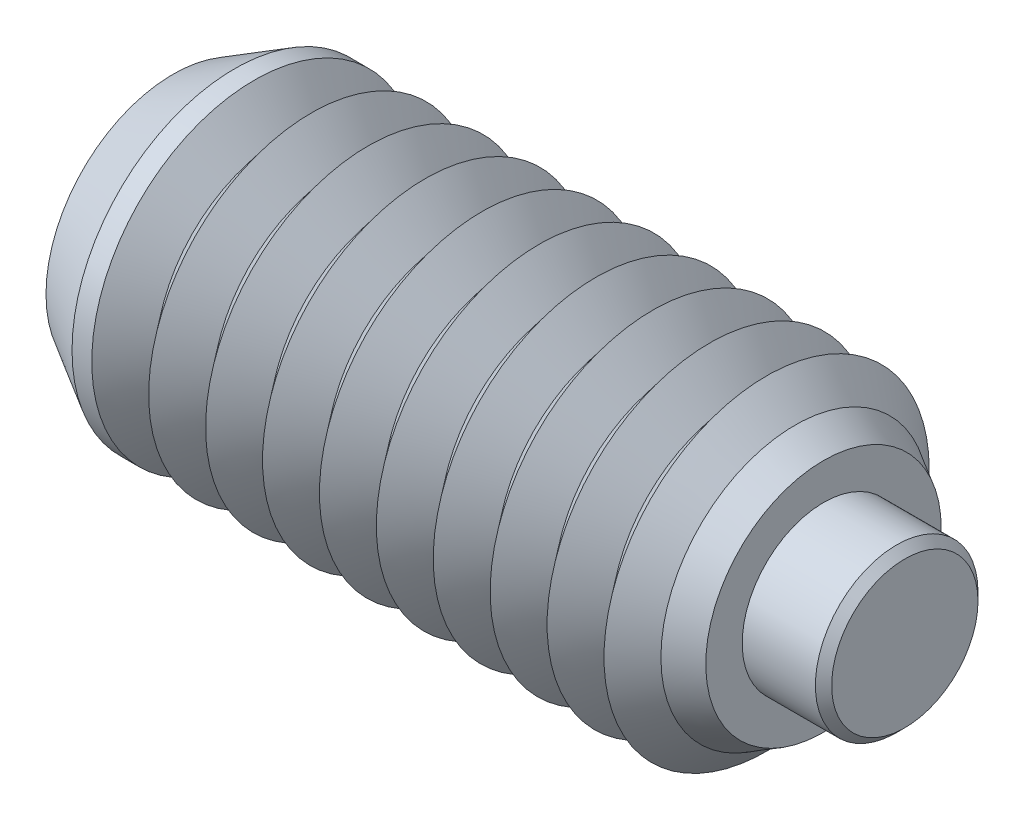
ISO-10303-21;
HEADER;
FILE_DESCRIPTION(('STEP AP214'),'2;1');
FILE_NAME('part.step','',(''),(''),'','','');
FILE_SCHEMA(('AUTOMOTIVE_DESIGN { 1 0 10303 214 1 1 1 1 }'));
ENDSEC;
DATA;
#1=APPLICATION_CONTEXT('core data for automotive mechanical design processes');
#2=APPLICATION_PROTOCOL_DEFINITION('international standard','automotive_design',2000,#1);
#3=PRODUCT_CONTEXT('',#1,'mechanical');
#4=PRODUCT('Part','Part','',(#3));
#5=PRODUCT_RELATED_PRODUCT_CATEGORY('part','',(#4));
#6=PRODUCT_DEFINITION_FORMATION('','',#4);
#7=PRODUCT_DEFINITION_CONTEXT('part definition',#1,'design');
#8=PRODUCT_DEFINITION('design','',#6,#7);
#9=PRODUCT_DEFINITION_SHAPE('','',#8);
#10=(LENGTH_UNIT() NAMED_UNIT(*) SI_UNIT(.MILLI.,.METRE.));
#11=(NAMED_UNIT(*) PLANE_ANGLE_UNIT() SI_UNIT($,.RADIAN.));
#12=(NAMED_UNIT(*) SI_UNIT($,.STERADIAN.) SOLID_ANGLE_UNIT());
#13=UNCERTAINTY_MEASURE_WITH_UNIT(LENGTH_MEASURE(1.E-05),#10,'distance_accuracy_value','');
#14=(GEOMETRIC_REPRESENTATION_CONTEXT(3) GLOBAL_UNCERTAINTY_ASSIGNED_CONTEXT((#13)) GLOBAL_UNIT_ASSIGNED_CONTEXT((#10,
#11,#12)) REPRESENTATION_CONTEXT('',''));
#15=CARTESIAN_POINT('',(0.,0.,0.));
#16=DIRECTION('',(0.,0.,1.));
#17=DIRECTION('',(1.,0.,0.));
#18=AXIS2_PLACEMENT_3D('',#15,#16,#17);
#19=CARTESIAN_POINT('',(1.35,0.,0.));
#20=DIRECTION('',(-1.,0.,0.));
#21=DIRECTION('',(0.,0.,1.));
#22=AXIS2_PLACEMENT_3D('',#19,#20,#21);
#23=CYLINDRICAL_SURFACE('',#22,1.);
#24=CARTESIAN_POINT('',(1.25,0.,0.));
#25=DIRECTION('',(1.,0.,0.));
#26=DIRECTION('',(0.,0.,-1.));
#27=AXIS2_PLACEMENT_3D('',#24,#25,#26);
#28=CIRCLE('',#27,1.);
#29=CARTESIAN_POINT('',(1.25,0.,-1.));
#30=VERTEX_POINT('',#29);
#31=EDGE_CURVE('P0_E10',#30,#30,#28,.F.);
#32=ORIENTED_EDGE('',*,*,#31,.T.);
#33=EDGE_LOOP('',(#32));
#34=FACE_BOUND('',#33,.T.);
#35=CARTESIAN_POINT('',(-0.65,0.,0.));
#36=DIRECTION('',(1.,0.,0.));
#37=DIRECTION('',(0.,0.,-1.));
#38=AXIS2_PLACEMENT_3D('',#35,#36,#37);
#39=CIRCLE('',#38,1.);
#40=CARTESIAN_POINT('',(-0.65,0.,-1.));
#41=VERTEX_POINT('',#40);
#42=EDGE_CURVE('P0_E25',#41,#41,#39,.T.);
#43=ORIENTED_EDGE('',*,*,#42,.T.);
#44=EDGE_LOOP('',(#43));
#45=FACE_BOUND('',#44,.T.);
#46=ADVANCED_FACE('P0_F14',(#34,#45),#23,.T.);
#47=CARTESIAN_POINT('',(1.35,0.,0.));
#48=DIRECTION('',(1.,0.,0.));
#49=DIRECTION('',(0.,0.,-1.));
#50=AXIS2_PLACEMENT_3D('',#47,#48,#49);
#51=PLANE('',#50);
#52=CARTESIAN_POINT('',(1.35,0.,0.));
#53=DIRECTION('',(1.,0.,0.));
#54=DIRECTION('',(0.,0.,-1.));
#55=AXIS2_PLACEMENT_3D('',#52,#53,#54);
#56=CIRCLE('',#55,0.899999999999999);
#57=CARTESIAN_POINT('',(1.35,0.,-0.899999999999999));
#58=VERTEX_POINT('',#57);
#59=EDGE_CURVE('P0_E21',#58,#58,#56,.T.);
#60=ORIENTED_EDGE('',*,*,#59,.T.);
#61=EDGE_LOOP('',(#60));
#62=FACE_BOUND('',#61,.T.);
#63=ADVANCED_FACE('P0_F35',(#62),#51,.T.);
#64=CARTESIAN_POINT('',(-0.65,0.,0.));
#65=DIRECTION('',(1.,0.,0.));
#66=DIRECTION('',(0.,0.,-1.));
#67=AXIS2_PLACEMENT_3D('',#64,#65,#66);
#68=PLANE('',#67);
#69=ORIENTED_EDGE('',*,*,#42,.F.);
#70=EDGE_LOOP('',(#69));
#71=FACE_BOUND('',#70,.T.);
#72=ADVANCED_FACE('P0_F33',(#71),#68,.F.);
#73=CARTESIAN_POINT('',(1.35,0.,0.));
#74=DIRECTION('',(-1.,0.,0.));
#75=DIRECTION('',(0.,0.,1.));
#76=AXIS2_PLACEMENT_3D('',#73,#74,#75);
#77=CONICAL_SURFACE('',#76,0.899999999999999,0.785398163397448);
#78=ORIENTED_EDGE('',*,*,#31,.F.);
#79=EDGE_LOOP('',(#78));
#80=FACE_BOUND('',#79,.T.);
#81=ORIENTED_EDGE('',*,*,#59,.F.);
#82=EDGE_LOOP('',(#81));
#83=FACE_BOUND('',#82,.T.);
#84=ADVANCED_FACE('P0_F16',(#80,#83),#77,.T.);
#85=CLOSED_SHELL('',(#46,#63,#72,#84));
#86=MANIFOLD_SOLID_BREP('P0_B1',#85);
#87=CARTESIAN_POINT('',(-7.65,0.,0.));
#88=DIRECTION('',(1.,0.,0.));
#89=DIRECTION('',(0.,0.,-1.));
#90=AXIS2_PLACEMENT_3D('',#87,#88,#89);
#91=CYLINDRICAL_SURFACE('',#90,2.);
#92=CARTESIAN_POINT('',(-6.65,0.,0.));
#93=DIRECTION('',(1.,0.,0.));
#94=DIRECTION('',(0.,0.,-1.));
#95=AXIS2_PLACEMENT_3D('',#92,#93,#94);
#96=CIRCLE('',#95,2.);
#97=CARTESIAN_POINT('',(-6.65,0.,-2.));
#98=VERTEX_POINT('',#97);
#99=EDGE_CURVE('P1_E226',#98,#98,#96,.T.);
#100=ORIENTED_EDGE('',*,*,#99,.F.);
#101=EDGE_LOOP('',(#100));
#102=FACE_BOUND('',#101,.T.);
#103=CARTESIAN_POINT('',(-6.89283423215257,0.,0.));
#104=DIRECTION('',(1.,0.,0.));
#105=DIRECTION('',(0.,0.,-1.));
#106=AXIS2_PLACEMENT_3D('',#103,#104,#105);
#107=CIRCLE('',#106,2.);
#108=CARTESIAN_POINT('',(-6.89283423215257,0.,-2.));
#109=VERTEX_POINT('',#108);
#110=EDGE_CURVE('P1_E229',#109,#109,#107,.T.);
#111=ORIENTED_EDGE('',*,*,#110,.T.);
#112=EDGE_LOOP('',(#111));
#113=FACE_BOUND('',#112,.T.);
#114=ADVANCED_FACE('P1_F15',(#102,#113),#91,.T.);
#115=CARTESIAN_POINT('',(-0.700000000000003,0.,0.));
#116=DIRECTION('',(1.,0.,0.));
#117=DIRECTION('',(0.,0.,-1.));
#118=AXIS2_PLACEMENT_3D('',#115,#116,#117);
#119=CONICAL_SURFACE('',#118,1.56285014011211,0.895664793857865);
#120=CARTESIAN_POINT('',(-0.350000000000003,0.,0.));
#121=DIRECTION('',(1.,0.,0.));
#122=DIRECTION('',(0.,0.,-1.));
#123=AXIS2_PLACEMENT_3D('',#120,#121,#122);
#124=CIRCLE('',#123,2.);
#125=CARTESIAN_POINT('',(-0.350000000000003,0.,-2.));
#126=VERTEX_POINT('',#125);
#127=EDGE_CURVE('P1_E284',#126,#126,#124,.T.);
#128=ORIENTED_EDGE('',*,*,#127,.F.);
#129=EDGE_LOOP('',(#128));
#130=FACE_BOUND('',#129,.T.);
#131=CARTESIAN_POINT('',(-0.700000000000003,0.,0.));
#132=DIRECTION('',(1.,0.,0.));
#133=DIRECTION('',(0.,0.,-1.));
#134=AXIS2_PLACEMENT_3D('',#131,#132,#133);
#135=CIRCLE('',#134,1.56285014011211);
#136=CARTESIAN_POINT('',(-0.700000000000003,0.,-1.56285014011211));
#137=VERTEX_POINT('',#136);
#138=EDGE_CURVE('P1_E289',#137,#137,#135,.T.);
#139=ORIENTED_EDGE('',*,*,#138,.T.);
#140=EDGE_LOOP('',(#139));
#141=FACE_BOUND('',#140,.T.);
#142=ADVANCED_FACE('P1_F214',(#130,#141),#119,.T.);
#143=CARTESIAN_POINT('',(-1.05,0.,0.));
#144=DIRECTION('',(-1.,0.,0.));
#145=DIRECTION('',(0.,0.,1.));
#146=AXIS2_PLACEMENT_3D('',#143,#144,#145);
#147=CONICAL_SURFACE('',#146,2.,0.895664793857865);
#148=ORIENTED_EDGE('',*,*,#138,.F.);
#149=EDGE_LOOP('',(#148));
#150=FACE_BOUND('',#149,.T.);
#151=CARTESIAN_POINT('',(-1.05,0.,0.));
#152=DIRECTION('',(1.,0.,0.));
#153=DIRECTION('',(0.,0.,-1.));
#154=AXIS2_PLACEMENT_3D('',#151,#152,#153);
#155=CIRCLE('',#154,2.);
#156=CARTESIAN_POINT('',(-1.05,0.,-2.));
#157=VERTEX_POINT('',#156);
#158=EDGE_CURVE('P1_E292',#157,#157,#155,.T.);
#159=ORIENTED_EDGE('',*,*,#158,.T.);
#160=EDGE_LOOP('',(#159));
#161=FACE_BOUND('',#160,.T.);
#162=ADVANCED_FACE('P1_F220',(#150,#161),#147,.T.);
#163=CARTESIAN_POINT('',(-0.65,0.,0.));
#164=DIRECTION('',(1.,0.,0.));
#165=DIRECTION('',(0.,1.,0.));
#166=AXIS2_PLACEMENT_3D('',#163,#164,#165);
#167=PLANE('',#166);
#168=CARTESIAN_POINT('',(-0.65,0.,0.));
#169=DIRECTION('',(1.,0.,0.));
#170=DIRECTION('',(0.,1.,0.));
#171=AXIS2_PLACEMENT_3D('',#168,#169,#170);
#172=CIRCLE('',#171,1.);
#173=CARTESIAN_POINT('',(-0.65,1.,0.));
#174=VERTEX_POINT('',#173);
#175=EDGE_CURVE('P1_E279',#174,#174,#172,.T.);
#176=ORIENTED_EDGE('',*,*,#175,.T.);
#177=EDGE_LOOP('',(#176));
#178=FACE_BOUND('',#177,.T.);
#179=ADVANCED_FACE('P1_F409',(#178),#167,.T.);
#180=CARTESIAN_POINT('',(-0.65,0.,0.));
#181=DIRECTION('',(1.,0.,0.));
#182=DIRECTION('',(0.,1.,0.));
#183=AXIS2_PLACEMENT_3D('',#180,#181,#182);
#184=CYLINDRICAL_SURFACE('',#183,1.);
#185=ORIENTED_EDGE('',*,*,#175,.F.);
#186=EDGE_LOOP('',(#185));
#187=FACE_BOUND('',#186,.T.);
#188=CARTESIAN_POINT('',(0.35,0.,0.));
#189=DIRECTION('',(1.,0.,0.));
#190=DIRECTION('',(0.,1.,0.));
#191=AXIS2_PLACEMENT_3D('',#188,#189,#190);
#192=CIRCLE('',#191,1.);
#193=CARTESIAN_POINT('',(0.35,1.,0.));
#194=VERTEX_POINT('',#193);
#195=EDGE_CURVE('P1_E281',#194,#194,#192,.T.);
#196=ORIENTED_EDGE('',*,*,#195,.T.);
#197=EDGE_LOOP('',(#196));
#198=FACE_BOUND('',#197,.T.);
#199=ADVANCED_FACE('P1_F210',(#187,#198),#184,.F.);
#200=CARTESIAN_POINT('',(0.35,1.44792740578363,0.));
#201=DIRECTION('',(1.,0.,0.));
#202=DIRECTION('',(0.,1.,0.));
#203=AXIS2_PLACEMENT_3D('',#200,#201,#202);
#204=PLANE('',#203);
#205=ORIENTED_EDGE('',*,*,#195,.F.);
#206=EDGE_LOOP('',(#205));
#207=FACE_BOUND('',#206,.T.);
#208=CARTESIAN_POINT('',(0.35,0.,0.));
#209=DIRECTION('',(1.,0.,0.));
#210=DIRECTION('',(0.,1.,0.));
#211=AXIS2_PLACEMENT_3D('',#208,#209,#210);
#212=CIRCLE('',#211,1.44792740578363);
#213=CARTESIAN_POINT('',(0.35,1.44792740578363,0.));
#214=VERTEX_POINT('',#213);
#215=EDGE_CURVE('P1_E121',#214,#214,#212,.T.);
#216=ORIENTED_EDGE('',*,*,#215,.T.);
#217=EDGE_LOOP('',(#216));
#218=FACE_BOUND('',#217,.T.);
#219=ADVANCED_FACE('P1_F206',(#207,#218),#204,.T.);
#220=CARTESIAN_POINT('',(0.35,0.,0.));
#221=DIRECTION('',(-1.,0.,0.));
#222=DIRECTION('',(0.,-1.,0.));
#223=AXIS2_PLACEMENT_3D('',#220,#221,#222);
#224=CONICAL_SURFACE('',#223,1.44792740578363,0.523598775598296);
#225=CARTESIAN_POINT('',(0.,0.,0.));
#226=DIRECTION('',(1.,0.,0.));
#227=DIRECTION('',(0.,0.,-1.));
#228=AXIS2_PLACEMENT_3D('',#225,#226,#227);
#229=CIRCLE('',#228,1.65);
#230=CARTESIAN_POINT('',(0.,0.,-1.65));
#231=VERTEX_POINT('',#230);
#232=EDGE_CURVE('P1_E236',#231,#231,#229,.T.);
#233=ORIENTED_EDGE('',*,*,#232,.T.);
#234=EDGE_LOOP('',(#233));
#235=FACE_BOUND('',#234,.T.);
#236=ORIENTED_EDGE('',*,*,#215,.F.);
#237=EDGE_LOOP('',(#236));
#238=FACE_BOUND('',#237,.T.);
#239=ADVANCED_FACE('P1_F203',(#235,#238),#224,.T.);
#240=CARTESIAN_POINT('',(0.,0.,0.));
#241=DIRECTION('',(-1.,0.,0.));
#242=DIRECTION('',(0.,0.,1.));
#243=AXIS2_PLACEMENT_3D('',#240,#241,#242);
#244=CONICAL_SURFACE('',#243,1.65,0.785398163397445);
#245=ORIENTED_EDGE('',*,*,#127,.T.);
#246=EDGE_LOOP('',(#245));
#247=FACE_BOUND('',#246,.T.);
#248=ORIENTED_EDGE('',*,*,#232,.F.);
#249=EDGE_LOOP('',(#248));
#250=FACE_BOUND('',#249,.T.);
#251=ADVANCED_FACE('P1_F17',(#247,#250),#244,.T.);
#252=CARTESIAN_POINT('',(-1.4,0.,0.));
#253=DIRECTION('',(1.,0.,0.));
#254=DIRECTION('',(0.,0.,-1.));
#255=AXIS2_PLACEMENT_3D('',#252,#253,#254);
#256=CONICAL_SURFACE('',#255,1.56285014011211,0.895664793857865);
#257=ORIENTED_EDGE('',*,*,#158,.F.);
#258=EDGE_LOOP('',(#257));
#259=FACE_BOUND('',#258,.T.);
#260=CARTESIAN_POINT('',(-1.4,0.,0.));
#261=DIRECTION('',(1.,0.,0.));
#262=DIRECTION('',(0.,0.,-1.));
#263=AXIS2_PLACEMENT_3D('',#260,#261,#262);
#264=CIRCLE('',#263,1.56285014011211);
#265=CARTESIAN_POINT('',(-1.4,0.,-1.56285014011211));
#266=VERTEX_POINT('',#265);
#267=EDGE_CURVE('P1_E295',#266,#266,#264,.T.);
#268=ORIENTED_EDGE('',*,*,#267,.T.);
#269=EDGE_LOOP('',(#268));
#270=FACE_BOUND('',#269,.T.);
#271=ADVANCED_FACE('P1_F403',(#259,#270),#256,.T.);
#272=CARTESIAN_POINT('',(-1.75,0.,0.));
#273=DIRECTION('',(-1.,0.,0.));
#274=DIRECTION('',(0.,0.,1.));
#275=AXIS2_PLACEMENT_3D('',#272,#273,#274);
#276=CONICAL_SURFACE('',#275,2.,0.895664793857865);
#277=ORIENTED_EDGE('',*,*,#267,.F.);
#278=EDGE_LOOP('',(#277));
#279=FACE_BOUND('',#278,.T.);
#280=CARTESIAN_POINT('',(-1.75,0.,0.));
#281=DIRECTION('',(1.,0.,0.));
#282=DIRECTION('',(0.,0.,-1.));
#283=AXIS2_PLACEMENT_3D('',#280,#281,#282);
#284=CIRCLE('',#283,2.);
#285=CARTESIAN_POINT('',(-1.75,0.,-2.));
#286=VERTEX_POINT('',#285);
#287=EDGE_CURVE('P1_E298',#286,#286,#284,.T.);
#288=ORIENTED_EDGE('',*,*,#287,.T.);
#289=EDGE_LOOP('',(#288));
#290=FACE_BOUND('',#289,.T.);
#291=ADVANCED_FACE('P1_F399',(#279,#290),#276,.T.);
#292=CARTESIAN_POINT('',(-2.1,0.,0.));
#293=DIRECTION('',(1.,0.,0.));
#294=DIRECTION('',(0.,0.,-1.));
#295=AXIS2_PLACEMENT_3D('',#292,#293,#294);
#296=CONICAL_SURFACE('',#295,1.56285014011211,0.895664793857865);
#297=ORIENTED_EDGE('',*,*,#287,.F.);
#298=EDGE_LOOP('',(#297));
#299=FACE_BOUND('',#298,.T.);
#300=CARTESIAN_POINT('',(-2.1,0.,0.));
#301=DIRECTION('',(1.,0.,0.));
#302=DIRECTION('',(0.,0.,-1.));
#303=AXIS2_PLACEMENT_3D('',#300,#301,#302);
#304=CIRCLE('',#303,1.56285014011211);
#305=CARTESIAN_POINT('',(-2.1,0.,-1.56285014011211));
#306=VERTEX_POINT('',#305);
#307=EDGE_CURVE('P1_E301',#306,#306,#304,.T.);
#308=ORIENTED_EDGE('',*,*,#307,.T.);
#309=EDGE_LOOP('',(#308));
#310=FACE_BOUND('',#309,.T.);
#311=ADVANCED_FACE('P1_F395',(#299,#310),#296,.T.);
#312=CARTESIAN_POINT('',(-2.45,0.,0.));
#313=DIRECTION('',(-1.,0.,0.));
#314=DIRECTION('',(0.,0.,1.));
#315=AXIS2_PLACEMENT_3D('',#312,#313,#314);
#316=CONICAL_SURFACE('',#315,2.,0.895664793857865);
#317=ORIENTED_EDGE('',*,*,#307,.F.);
#318=EDGE_LOOP('',(#317));
#319=FACE_BOUND('',#318,.T.);
#320=CARTESIAN_POINT('',(-2.45,0.,0.));
#321=DIRECTION('',(1.,0.,0.));
#322=DIRECTION('',(0.,0.,-1.));
#323=AXIS2_PLACEMENT_3D('',#320,#321,#322);
#324=CIRCLE('',#323,2.);
#325=CARTESIAN_POINT('',(-2.45,0.,-2.));
#326=VERTEX_POINT('',#325);
#327=EDGE_CURVE('P1_E304',#326,#326,#324,.T.);
#328=ORIENTED_EDGE('',*,*,#327,.T.);
#329=EDGE_LOOP('',(#328));
#330=FACE_BOUND('',#329,.T.);
#331=ADVANCED_FACE('P1_F391',(#319,#330),#316,.T.);
#332=CARTESIAN_POINT('',(-2.8,0.,0.));
#333=DIRECTION('',(1.,0.,0.));
#334=DIRECTION('',(0.,0.,-1.));
#335=AXIS2_PLACEMENT_3D('',#332,#333,#334);
#336=CONICAL_SURFACE('',#335,1.56285014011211,0.895664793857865);
#337=ORIENTED_EDGE('',*,*,#327,.F.);
#338=EDGE_LOOP('',(#337));
#339=FACE_BOUND('',#338,.T.);
#340=CARTESIAN_POINT('',(-2.8,0.,0.));
#341=DIRECTION('',(1.,0.,0.));
#342=DIRECTION('',(0.,0.,-1.));
#343=AXIS2_PLACEMENT_3D('',#340,#341,#342);
#344=CIRCLE('',#343,1.56285014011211);
#345=CARTESIAN_POINT('',(-2.8,0.,-1.56285014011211));
#346=VERTEX_POINT('',#345);
#347=EDGE_CURVE('P1_E307',#346,#346,#344,.T.);
#348=ORIENTED_EDGE('',*,*,#347,.T.);
#349=EDGE_LOOP('',(#348));
#350=FACE_BOUND('',#349,.T.);
#351=ADVANCED_FACE('P1_F387',(#339,#350),#336,.T.);
#352=CARTESIAN_POINT('',(-3.15,0.,0.));
#353=DIRECTION('',(-1.,0.,0.));
#354=DIRECTION('',(0.,0.,1.));
#355=AXIS2_PLACEMENT_3D('',#352,#353,#354);
#356=CONICAL_SURFACE('',#355,2.,0.895664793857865);
#357=ORIENTED_EDGE('',*,*,#347,.F.);
#358=EDGE_LOOP('',(#357));
#359=FACE_BOUND('',#358,.T.);
#360=CARTESIAN_POINT('',(-3.15,0.,0.));
#361=DIRECTION('',(1.,0.,0.));
#362=DIRECTION('',(0.,0.,-1.));
#363=AXIS2_PLACEMENT_3D('',#360,#361,#362);
#364=CIRCLE('',#363,2.);
#365=CARTESIAN_POINT('',(-3.15,0.,-2.));
#366=VERTEX_POINT('',#365);
#367=EDGE_CURVE('P1_E310',#366,#366,#364,.T.);
#368=ORIENTED_EDGE('',*,*,#367,.T.);
#369=EDGE_LOOP('',(#368));
#370=FACE_BOUND('',#369,.T.);
#371=ADVANCED_FACE('P1_F383',(#359,#370),#356,.T.);
#372=CARTESIAN_POINT('',(-3.5,0.,0.));
#373=DIRECTION('',(1.,0.,0.));
#374=DIRECTION('',(0.,0.,-1.));
#375=AXIS2_PLACEMENT_3D('',#372,#373,#374);
#376=CONICAL_SURFACE('',#375,1.56285014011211,0.895664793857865);
#377=ORIENTED_EDGE('',*,*,#367,.F.);
#378=EDGE_LOOP('',(#377));
#379=FACE_BOUND('',#378,.T.);
#380=CARTESIAN_POINT('',(-3.5,0.,0.));
#381=DIRECTION('',(1.,0.,0.));
#382=DIRECTION('',(0.,0.,-1.));
#383=AXIS2_PLACEMENT_3D('',#380,#381,#382);
#384=CIRCLE('',#383,1.56285014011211);
#385=CARTESIAN_POINT('',(-3.5,0.,-1.56285014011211));
#386=VERTEX_POINT('',#385);
#387=EDGE_CURVE('P1_E313',#386,#386,#384,.T.);
#388=ORIENTED_EDGE('',*,*,#387,.T.);
#389=EDGE_LOOP('',(#388));
#390=FACE_BOUND('',#389,.T.);
#391=ADVANCED_FACE('P1_F379',(#379,#390),#376,.T.);
#392=CARTESIAN_POINT('',(-3.85,0.,0.));
#393=DIRECTION('',(-1.,0.,0.));
#394=DIRECTION('',(0.,0.,1.));
#395=AXIS2_PLACEMENT_3D('',#392,#393,#394);
#396=CONICAL_SURFACE('',#395,2.,0.895664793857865);
#397=ORIENTED_EDGE('',*,*,#387,.F.);
#398=EDGE_LOOP('',(#397));
#399=FACE_BOUND('',#398,.T.);
#400=CARTESIAN_POINT('',(-3.85,0.,0.));
#401=DIRECTION('',(1.,0.,0.));
#402=DIRECTION('',(0.,0.,-1.));
#403=AXIS2_PLACEMENT_3D('',#400,#401,#402);
#404=CIRCLE('',#403,2.);
#405=CARTESIAN_POINT('',(-3.85,0.,-2.));
#406=VERTEX_POINT('',#405);
#407=EDGE_CURVE('P1_E316',#406,#406,#404,.T.);
#408=ORIENTED_EDGE('',*,*,#407,.T.);
#409=EDGE_LOOP('',(#408));
#410=FACE_BOUND('',#409,.T.);
#411=ADVANCED_FACE('P1_F375',(#399,#410),#396,.T.);
#412=CARTESIAN_POINT('',(-4.2,0.,0.));
#413=DIRECTION('',(1.,0.,0.));
#414=DIRECTION('',(0.,0.,-1.));
#415=AXIS2_PLACEMENT_3D('',#412,#413,#414);
#416=CONICAL_SURFACE('',#415,1.56285014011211,0.895664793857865);
#417=ORIENTED_EDGE('',*,*,#407,.F.);
#418=EDGE_LOOP('',(#417));
#419=FACE_BOUND('',#418,.T.);
#420=CARTESIAN_POINT('',(-4.2,0.,0.));
#421=DIRECTION('',(1.,0.,0.));
#422=DIRECTION('',(0.,0.,-1.));
#423=AXIS2_PLACEMENT_3D('',#420,#421,#422);
#424=CIRCLE('',#423,1.56285014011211);
#425=CARTESIAN_POINT('',(-4.2,0.,-1.56285014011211));
#426=VERTEX_POINT('',#425);
#427=EDGE_CURVE('P1_E319',#426,#426,#424,.T.);
#428=ORIENTED_EDGE('',*,*,#427,.T.);
#429=EDGE_LOOP('',(#428));
#430=FACE_BOUND('',#429,.T.);
#431=ADVANCED_FACE('P1_F371',(#419,#430),#416,.T.);
#432=CARTESIAN_POINT('',(-4.55,0.,0.));
#433=DIRECTION('',(-1.,0.,0.));
#434=DIRECTION('',(0.,0.,1.));
#435=AXIS2_PLACEMENT_3D('',#432,#433,#434);
#436=CONICAL_SURFACE('',#435,2.,0.895664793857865);
#437=ORIENTED_EDGE('',*,*,#427,.F.);
#438=EDGE_LOOP('',(#437));
#439=FACE_BOUND('',#438,.T.);
#440=CARTESIAN_POINT('',(-4.55,0.,0.));
#441=DIRECTION('',(1.,0.,0.));
#442=DIRECTION('',(0.,0.,-1.));
#443=AXIS2_PLACEMENT_3D('',#440,#441,#442);
#444=CIRCLE('',#443,2.);
#445=CARTESIAN_POINT('',(-4.55,0.,-2.));
#446=VERTEX_POINT('',#445);
#447=EDGE_CURVE('P1_E322',#446,#446,#444,.T.);
#448=ORIENTED_EDGE('',*,*,#447,.T.);
#449=EDGE_LOOP('',(#448));
#450=FACE_BOUND('',#449,.T.);
#451=ADVANCED_FACE('P1_F367',(#439,#450),#436,.T.);
#452=CARTESIAN_POINT('',(-4.9,0.,0.));
#453=DIRECTION('',(1.,0.,0.));
#454=DIRECTION('',(0.,0.,-1.));
#455=AXIS2_PLACEMENT_3D('',#452,#453,#454);
#456=CONICAL_SURFACE('',#455,1.56285014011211,0.895664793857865);
#457=ORIENTED_EDGE('',*,*,#447,.F.);
#458=EDGE_LOOP('',(#457));
#459=FACE_BOUND('',#458,.T.);
#460=CARTESIAN_POINT('',(-4.9,0.,0.));
#461=DIRECTION('',(1.,0.,0.));
#462=DIRECTION('',(0.,0.,-1.));
#463=AXIS2_PLACEMENT_3D('',#460,#461,#462);
#464=CIRCLE('',#463,1.56285014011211);
#465=CARTESIAN_POINT('',(-4.9,0.,-1.56285014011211));
#466=VERTEX_POINT('',#465);
#467=EDGE_CURVE('P1_E325',#466,#466,#464,.T.);
#468=ORIENTED_EDGE('',*,*,#467,.T.);
#469=EDGE_LOOP('',(#468));
#470=FACE_BOUND('',#469,.T.);
#471=ADVANCED_FACE('P1_F363',(#459,#470),#456,.T.);
#472=CARTESIAN_POINT('',(-5.25,0.,0.));
#473=DIRECTION('',(-1.,0.,0.));
#474=DIRECTION('',(0.,0.,1.));
#475=AXIS2_PLACEMENT_3D('',#472,#473,#474);
#476=CONICAL_SURFACE('',#475,2.,0.895664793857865);
#477=ORIENTED_EDGE('',*,*,#467,.F.);
#478=EDGE_LOOP('',(#477));
#479=FACE_BOUND('',#478,.T.);
#480=CARTESIAN_POINT('',(-5.25,0.,0.));
#481=DIRECTION('',(1.,0.,0.));
#482=DIRECTION('',(0.,0.,-1.));
#483=AXIS2_PLACEMENT_3D('',#480,#481,#482);
#484=CIRCLE('',#483,2.);
#485=CARTESIAN_POINT('',(-5.25,0.,-2.));
#486=VERTEX_POINT('',#485);
#487=EDGE_CURVE('P1_E328',#486,#486,#484,.T.);
#488=ORIENTED_EDGE('',*,*,#487,.T.);
#489=EDGE_LOOP('',(#488));
#490=FACE_BOUND('',#489,.T.);
#491=ADVANCED_FACE('P1_F359',(#479,#490),#476,.T.);
#492=CARTESIAN_POINT('',(-5.6,0.,0.));
#493=DIRECTION('',(1.,0.,0.));
#494=DIRECTION('',(0.,0.,-1.));
#495=AXIS2_PLACEMENT_3D('',#492,#493,#494);
#496=CONICAL_SURFACE('',#495,1.56285014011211,0.895664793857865);
#497=ORIENTED_EDGE('',*,*,#487,.F.);
#498=EDGE_LOOP('',(#497));
#499=FACE_BOUND('',#498,.T.);
#500=CARTESIAN_POINT('',(-5.6,0.,0.));
#501=DIRECTION('',(1.,0.,0.));
#502=DIRECTION('',(0.,0.,-1.));
#503=AXIS2_PLACEMENT_3D('',#500,#501,#502);
#504=CIRCLE('',#503,1.56285014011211);
#505=CARTESIAN_POINT('',(-5.6,0.,-1.56285014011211));
#506=VERTEX_POINT('',#505);
#507=EDGE_CURVE('P1_E331',#506,#506,#504,.T.);
#508=ORIENTED_EDGE('',*,*,#507,.T.);
#509=EDGE_LOOP('',(#508));
#510=FACE_BOUND('',#509,.T.);
#511=ADVANCED_FACE('P1_F355',(#499,#510),#496,.T.);
#512=CARTESIAN_POINT('',(-5.95,0.,0.));
#513=DIRECTION('',(-1.,0.,0.));
#514=DIRECTION('',(0.,0.,1.));
#515=AXIS2_PLACEMENT_3D('',#512,#513,#514);
#516=CONICAL_SURFACE('',#515,2.,0.895664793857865);
#517=ORIENTED_EDGE('',*,*,#507,.F.);
#518=EDGE_LOOP('',(#517));
#519=FACE_BOUND('',#518,.T.);
#520=CARTESIAN_POINT('',(-5.95,0.,0.));
#521=DIRECTION('',(1.,0.,0.));
#522=DIRECTION('',(0.,0.,-1.));
#523=AXIS2_PLACEMENT_3D('',#520,#521,#522);
#524=CIRCLE('',#523,2.);
#525=CARTESIAN_POINT('',(-5.95,0.,-2.));
#526=VERTEX_POINT('',#525);
#527=EDGE_CURVE('P1_E334',#526,#526,#524,.T.);
#528=ORIENTED_EDGE('',*,*,#527,.T.);
#529=EDGE_LOOP('',(#528));
#530=FACE_BOUND('',#529,.T.);
#531=ADVANCED_FACE('P1_F349',(#519,#530),#516,.T.);
#532=CARTESIAN_POINT('',(-6.3,0.,0.));
#533=DIRECTION('',(1.,0.,0.));
#534=DIRECTION('',(0.,0.,-1.));
#535=AXIS2_PLACEMENT_3D('',#532,#533,#534);
#536=CONICAL_SURFACE('',#535,1.56285014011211,0.895664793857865);
#537=ORIENTED_EDGE('',*,*,#527,.F.);
#538=EDGE_LOOP('',(#537));
#539=FACE_BOUND('',#538,.T.);
#540=CARTESIAN_POINT('',(-6.3,0.,0.));
#541=DIRECTION('',(1.,0.,0.));
#542=DIRECTION('',(0.,0.,-1.));
#543=AXIS2_PLACEMENT_3D('',#540,#541,#542);
#544=CIRCLE('',#543,1.56285014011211);
#545=CARTESIAN_POINT('',(-6.3,0.,-1.56285014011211));
#546=VERTEX_POINT('',#545);
#547=EDGE_CURVE('P1_E232',#546,#546,#544,.T.);
#548=ORIENTED_EDGE('',*,*,#547,.T.);
#549=EDGE_LOOP('',(#548));
#550=FACE_BOUND('',#549,.T.);
#551=ADVANCED_FACE('P1_F340',(#539,#550),#536,.T.);
#552=CARTESIAN_POINT('',(-6.65,0.,0.));
#553=DIRECTION('',(-1.,0.,0.));
#554=DIRECTION('',(0.,0.,1.));
#555=AXIS2_PLACEMENT_3D('',#552,#553,#554);
#556=CONICAL_SURFACE('',#555,2.,0.895664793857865);
#557=ORIENTED_EDGE('',*,*,#547,.F.);
#558=EDGE_LOOP('',(#557));
#559=FACE_BOUND('',#558,.T.);
#560=ORIENTED_EDGE('',*,*,#99,.T.);
#561=EDGE_LOOP('',(#560));
#562=FACE_BOUND('',#561,.T.);
#563=ADVANCED_FACE('P1_F342',(#559,#562),#556,.T.);
#564=CARTESIAN_POINT('',(-7.65,0.,0.));
#565=DIRECTION('',(1.,0.,0.));
#566=DIRECTION('',(0.,0.,1.));
#567=AXIS2_PLACEMENT_3D('',#564,#565,#566);
#568=CONICAL_SURFACE('',#567,1.56285014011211,0.5235987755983);
#569=ORIENTED_EDGE('',*,*,#110,.F.);
#570=EDGE_LOOP('',(#569));
#571=FACE_BOUND('',#570,.T.);
#572=CARTESIAN_POINT('',(-7.65,0.,0.));
#573=DIRECTION('',(-1.,0.,0.));
#574=DIRECTION('',(0.,0.,1.));
#575=AXIS2_PLACEMENT_3D('',#572,#573,#574);
#576=CIRCLE('',#575,1.56285014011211);
#577=CARTESIAN_POINT('',(-7.65,0.,1.56285014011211));
#578=VERTEX_POINT('',#577);
#579=EDGE_CURVE('P1_E231',#578,#578,#576,.T.);
#580=ORIENTED_EDGE('',*,*,#579,.F.);
#581=EDGE_LOOP('',(#580));
#582=FACE_BOUND('',#581,.T.);
#583=ADVANCED_FACE('P1_F159',(#571,#582),#568,.T.);
#584=CARTESIAN_POINT('',(-7.65,0.,0.));
#585=DIRECTION('',(1.,0.,0.));
#586=DIRECTION('',(0.,0.,-1.));
#587=AXIS2_PLACEMENT_3D('',#584,#585,#586);
#588=PLANE('',#587);
#589=CARTESIAN_POINT('',(-7.65,0.,0.));
#590=DIRECTION('',(1.,0.,0.));
#591=DIRECTION('',(0.,0.,-1.));
#592=AXIS2_PLACEMENT_3D('',#589,#590,#591);
#593=CIRCLE('',#592,1.15470053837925);
#594=CARTESIAN_POINT('',(-7.65,-1.,-0.577350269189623));
#595=VERTEX_POINT('',#594);
#596=CARTESIAN_POINT('',(-7.65,0.,-1.15470053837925));
#597=VERTEX_POINT('',#596);
#598=EDGE_CURVE('P1_E19',#595,#597,#593,.T.);
#599=ORIENTED_EDGE('',*,*,#598,.T.);
#600=CARTESIAN_POINT('',(-7.65,1.,-0.577350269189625));
#601=VERTEX_POINT('',#600);
#602=EDGE_CURVE('P1_E10',#597,#601,#593,.T.);
#603=ORIENTED_EDGE('',*,*,#602,.T.);
#604=CARTESIAN_POINT('',(-7.65,0.999999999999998,0.577350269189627));
#605=VERTEX_POINT('',#604);
#606=EDGE_CURVE('P1_E24',#601,#605,#593,.T.);
#607=ORIENTED_EDGE('',*,*,#606,.T.);
#608=CARTESIAN_POINT('',(-7.65,0.,0.));
#609=DIRECTION('',(-1.,0.,0.));
#610=DIRECTION('',(0.,0.,1.));
#611=AXIS2_PLACEMENT_3D('',#608,#609,#610);
#612=CIRCLE('',#611,1.15470053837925);
#613=CARTESIAN_POINT('',(-7.65,0.,1.15470053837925));
#614=VERTEX_POINT('',#613);
#615=EDGE_CURVE('P1_E92',#614,#605,#612,.T.);
#616=ORIENTED_EDGE('',*,*,#615,.F.);
#617=CARTESIAN_POINT('',(-7.65,-1.,0.577350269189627));
#618=VERTEX_POINT('',#617);
#619=EDGE_CURVE('P1_E101',#614,#618,#593,.T.);
#620=ORIENTED_EDGE('',*,*,#619,.T.);
#621=EDGE_CURVE('P1_E107',#618,#595,#593,.T.);
#622=ORIENTED_EDGE('',*,*,#621,.T.);
#623=EDGE_LOOP('',(#599,#603,#607,#616,#620,#622));
#624=FACE_BOUND('',#623,.T.);
#625=ORIENTED_EDGE('',*,*,#579,.T.);
#626=EDGE_LOOP('',(#625));
#627=FACE_BOUND('',#626,.T.);
#628=ADVANCED_FACE('P1_F108',(#624,#627),#588,.F.);
#629=CARTESIAN_POINT('',(-7.65,0.,0.));
#630=DIRECTION('',(-1.,0.,0.));
#631=DIRECTION('',(0.,0.,1.));
#632=AXIS2_PLACEMENT_3D('',#629,#630,#631);
#633=CONICAL_SURFACE('',#632,1.15470053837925,1.0471975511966);
#634=ORIENTED_EDGE('',*,*,#598,.F.);
#635=CARTESIAN_POINT('',(-7.65006667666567,0.000199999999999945,-1.15481600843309));
#636=CARTESIAN_POINT('',(-7.63540897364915,-0.04374731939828,-1.12944301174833));
#637=CARTESIAN_POINT('',(-7.62207772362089,-0.0880739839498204,-1.10385100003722));
#638=CARTESIAN_POINT('',(-7.59880650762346,-0.177495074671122,-1.05222370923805));
#639=CARTESIAN_POINT('',(-7.58887477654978,-0.222591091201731,-1.02618751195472));
#640=CARTESIAN_POINT('',(-7.57341269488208,-0.312224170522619,-0.97443782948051));
#641=CARTESIAN_POINT('',(-7.56777946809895,-0.356747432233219,-0.948732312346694));
#642=CARTESIAN_POINT('',(-7.56105128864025,-0.446003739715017,-0.897200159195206));
#643=CARTESIAN_POINT('',(-7.55995076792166,-0.490736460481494,-0.871373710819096));
#644=CARTESIAN_POINT('',(-7.56222505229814,-0.574341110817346,-0.823104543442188));
#645=CARTESIAN_POINT('',(-7.56504143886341,-0.613225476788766,-0.80065464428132));
#646=CARTESIAN_POINT('',(-7.57397245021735,-0.690740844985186,-0.755901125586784));
#647=CARTESIAN_POINT('',(-7.5800901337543,-0.729371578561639,-0.733597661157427));
#648=CARTESIAN_POINT('',(-7.59538572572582,-0.807047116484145,-0.688751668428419));
#649=CARTESIAN_POINT('',(-7.60462855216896,-0.846082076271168,-0.666214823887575));
#650=CARTESIAN_POINT('',(-7.62560684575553,-0.923569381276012,-0.62147750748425));
#651=CARTESIAN_POINT('',(-7.63733737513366,-0.962022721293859,-0.599276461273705));
#652=CARTESIAN_POINT('',(-7.65006667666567,-1.0002,-0.577234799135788));
#653=B_SPLINE_CURVE_WITH_KNOTS('',3,(#635,#636,#637,#638,#639,#640,#641,#642,#643,#644,#645,
#646,#647,#648,#649,#650,#651,#652),.UNSPECIFIED.,.F.,.F.,(4,2,2,2,2,2,2,2,4),(0.,
0.158523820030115,0.317428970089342,0.472400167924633,0.627180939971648,0.762016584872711,
0.896977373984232,1.03493410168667,1.17261952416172),.UNSPECIFIED.);
#654=EDGE_CURVE('P1_E130',#597,#595,#653,.T.);
#655=ORIENTED_EDGE('',*,*,#654,.F.);
#656=EDGE_LOOP('',(#634,#655));
#657=FACE_BOUND('',#656,.T.);
#658=ADVANCED_FACE('P1_F158',(#657),#633,.F.);
#659=ORIENTED_EDGE('',*,*,#621,.F.);
#660=CARTESIAN_POINT('',(-8.02183528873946,-1.,-1.49514512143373));
#661=CARTESIAN_POINT('',(-8.00111502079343,-1.,-1.45196126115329));
#662=CARTESIAN_POINT('',(-7.98061367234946,-1.,-1.40867282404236));
#663=CARTESIAN_POINT('',(-7.9401634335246,-1.,-1.32182947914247));
#664=CARTESIAN_POINT('',(-7.92021464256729,-1.,-1.27827452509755));
#665=CARTESIAN_POINT('',(-7.86114515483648,-1.,-1.14662339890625));
#666=CARTESIAN_POINT('',(-7.82305252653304,-1.,-1.05805724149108));
#667=CARTESIAN_POINT('',(-7.75024582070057,-1.,-0.876833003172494));
#668=CARTESIAN_POINT('',(-7.71564584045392,-1.,-0.784128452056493));
#669=CARTESIAN_POINT('',(-7.65407347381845,-1.,-0.596331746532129));
#670=CARTESIAN_POINT('',(-7.62708128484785,-1.,-0.501246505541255));
#671=CARTESIAN_POINT('',(-7.59577577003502,-1.,-0.356699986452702));
#672=CARTESIAN_POINT('',(-7.58687509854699,-1.,-0.308244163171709));
#673=CARTESIAN_POINT('',(-7.57274243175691,-1.,-0.210788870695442));
#674=CARTESIAN_POINT('',(-7.56751018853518,-1.,-0.161789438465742));
#675=CARTESIAN_POINT('',(-7.56119898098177,-1.,-0.064106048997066));
#676=CARTESIAN_POINT('',(-7.56007100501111,-1.,-0.0154253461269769));
#677=CARTESIAN_POINT('',(-7.56193297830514,-1.,0.0818553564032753));
#678=CARTESIAN_POINT('',(-7.56492318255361,-1.,0.130455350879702));
#679=CARTESIAN_POINT('',(-7.5771183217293,-1.,0.250369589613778));
#680=CARTESIAN_POINT('',(-7.58860856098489,-1.,0.321451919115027));
#681=CARTESIAN_POINT('',(-7.61824031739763,-1.,0.462229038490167));
#682=CARTESIAN_POINT('',(-7.63638985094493,-1.,0.531922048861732));
#683=CARTESIAN_POINT('',(-7.67786972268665,-1.,0.671415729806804));
#684=CARTESIAN_POINT('',(-7.70130716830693,-1.,0.741183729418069));
#685=CARTESIAN_POINT('',(-7.75156448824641,-1.,0.879438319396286));
#686=CARTESIAN_POINT('',(-7.77838317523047,-1.,0.947925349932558));
#687=CARTESIAN_POINT('',(-7.85005391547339,-1.,1.12214515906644));
#688=CARTESIAN_POINT('',(-7.89657230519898,-1.,1.22718574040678));
#689=CARTESIAN_POINT('',(-7.99287692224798,-1.,1.43575968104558));
#690=CARTESIAN_POINT('',(-8.04266398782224,-1.,1.53929264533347));
#691=CARTESIAN_POINT('',(-8.14433644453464,-1.,1.74546702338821));
#692=CARTESIAN_POINT('',(-8.19622418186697,-1.,1.84810727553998));
#693=CARTESIAN_POINT('',(-8.30133836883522,-1.,2.05270058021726));
#694=CARTESIAN_POINT('',(-8.35456486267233,-1.,2.15465360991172));
#695=CARTESIAN_POINT('',(-8.4568669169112,-1.,2.34846553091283));
#696=CARTESIAN_POINT('',(-8.50585965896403,-1.,2.44036823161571));
#697=CARTESIAN_POINT('',(-8.60440313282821,-1.,2.623877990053));
#698=CARTESIAN_POINT('',(-8.65395388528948,-1.,2.71548503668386));
#699=CARTESIAN_POINT('',(-8.75334710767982,-1.,2.89823865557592));
#700=CARTESIAN_POINT('',(-8.80318851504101,-1.,2.98938580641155));
#701=CARTESIAN_POINT('',(-8.90319572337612,-1.,3.17149583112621));
#702=CARTESIAN_POINT('',(-8.95336150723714,-1.,3.26245871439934));
#703=CARTESIAN_POINT('',(-9.00364621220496,-1.,3.35335539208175));
#704=B_SPLINE_CURVE_WITH_KNOTS('',3,(#660,#661,#662,#663,#664,#665,#666,#667,#668,#669,#670,
#671,#672,#673,#674,#675,#676,#677,#678,#679,#680,#681,#682,#683,#684,#685,#686,#687,#688,#689,
#690,#691,#692,#693,#694,#695,#696,#697,#698,#699,#700,#701,#702,#703),.UNSPECIFIED.,.F.,.F.,(4,
2,2,2,2,2,2,2,2,2,2,2,2,2,2,2,2,2,2,2,2,4),(0.,0.14369034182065,0.287406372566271,
0.576560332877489,0.873259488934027,1.16917907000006,1.31686338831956,1.46453772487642,
1.61044269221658,1.75635669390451,1.97192533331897,2.18775432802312,2.40842600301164,
2.62902040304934,2.97355048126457,3.31816926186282,3.6631841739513,4.00821049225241,
4.32064609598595,4.63309330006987,4.9447457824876,5.2563819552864),.UNSPECIFIED.);
#705=EDGE_CURVE('P1_E128',#595,#618,#704,.T.);
#706=ORIENTED_EDGE('',*,*,#705,.F.);
#707=EDGE_LOOP('',(#659,#706));
#708=FACE_BOUND('',#707,.T.);
#709=ADVANCED_FACE('P1_F461',(#708),#633,.F.);
#710=ORIENTED_EDGE('',*,*,#619,.F.);
#711=CARTESIAN_POINT('',(-7.65006667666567,-1.0002,0.577234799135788));
#712=CARTESIAN_POINT('',(-7.63540897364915,-0.95625268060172,0.602607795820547));
#713=CARTESIAN_POINT('',(-7.6220777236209,-0.91192601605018,0.628199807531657));
#714=CARTESIAN_POINT('',(-7.59880650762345,-0.822504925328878,0.679827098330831));
#715=CARTESIAN_POINT('',(-7.58887477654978,-0.777408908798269,0.705863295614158));
#716=CARTESIAN_POINT('',(-7.57341269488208,-0.687775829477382,0.757612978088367));
#717=CARTESIAN_POINT('',(-7.56777946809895,-0.643252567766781,0.783318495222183));
#718=CARTESIAN_POINT('',(-7.56105128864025,-0.553996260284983,0.834850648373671));
#719=CARTESIAN_POINT('',(-7.55995076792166,-0.509263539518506,0.860677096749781));
#720=CARTESIAN_POINT('',(-7.56222505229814,-0.425658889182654,0.908946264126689));
#721=CARTESIAN_POINT('',(-7.56504143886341,-0.386774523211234,0.931396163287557));
#722=CARTESIAN_POINT('',(-7.57397245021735,-0.309259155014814,0.976149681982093));
#723=CARTESIAN_POINT('',(-7.5800901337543,-0.270628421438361,0.998453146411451));
#724=CARTESIAN_POINT('',(-7.59538572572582,-0.192952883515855,1.04329913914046));
#725=CARTESIAN_POINT('',(-7.60462855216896,-0.153917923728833,1.0658359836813));
#726=CARTESIAN_POINT('',(-7.62560684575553,-0.076430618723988,1.11057330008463));
#727=CARTESIAN_POINT('',(-7.63733737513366,-0.0379772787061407,1.13277434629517));
#728=CARTESIAN_POINT('',(-7.65006667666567,0.000200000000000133,1.15481600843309));
#729=B_SPLINE_CURVE_WITH_KNOTS('',3,(#711,#712,#713,#714,#715,#716,#717,#718,#719,#720,#721,
#722,#723,#724,#725,#726,#727,#728),.UNSPECIFIED.,.F.,.F.,(4,2,2,2,2,2,2,2,4),(0.,
0.158523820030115,0.317428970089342,0.472400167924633,0.627180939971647,0.76201658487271,
0.896977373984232,1.03493410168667,1.17261952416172),.UNSPECIFIED.);
#730=EDGE_CURVE('P1_E96',#618,#614,#729,.T.);
#731=ORIENTED_EDGE('',*,*,#730,.F.);
#732=EDGE_LOOP('',(#710,#731));
#733=FACE_BOUND('',#732,.T.);
#734=ADVANCED_FACE('P1_F102',(#733),#633,.F.);
#735=ORIENTED_EDGE('',*,*,#615,.T.);
#736=CARTESIAN_POINT('',(-7.65006667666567,-0.000200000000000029,1.15481600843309));
#737=CARTESIAN_POINT('',(-7.63540897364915,0.0437473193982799,1.12944301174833));
#738=CARTESIAN_POINT('',(-7.6220777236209,0.0880739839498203,1.10385100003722));
#739=CARTESIAN_POINT('',(-7.59880650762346,0.177495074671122,1.05222370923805));
#740=CARTESIAN_POINT('',(-7.58887477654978,0.222591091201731,1.02618751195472));
#741=CARTESIAN_POINT('',(-7.57341269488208,0.312224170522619,0.97443782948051));
#742=CARTESIAN_POINT('',(-7.56777946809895,0.356747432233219,0.948732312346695));
#743=CARTESIAN_POINT('',(-7.56105128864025,0.446003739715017,0.897200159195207));
#744=CARTESIAN_POINT('',(-7.55995076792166,0.490736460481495,0.871373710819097));
#745=CARTESIAN_POINT('',(-7.56222505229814,0.574341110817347,0.823104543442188));
#746=CARTESIAN_POINT('',(-7.56504143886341,0.613225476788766,0.800654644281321));
#747=CARTESIAN_POINT('',(-7.57397245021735,0.690740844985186,0.755901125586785));
#748=CARTESIAN_POINT('',(-7.5800901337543,0.729371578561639,0.733597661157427));
#749=CARTESIAN_POINT('',(-7.59538572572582,0.807047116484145,0.688751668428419));
#750=CARTESIAN_POINT('',(-7.60462855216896,0.846082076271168,0.666214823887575));
#751=CARTESIAN_POINT('',(-7.62560684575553,0.923569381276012,0.62147750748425));
#752=CARTESIAN_POINT('',(-7.63733737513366,0.962022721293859,0.599276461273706));
#753=CARTESIAN_POINT('',(-7.65006667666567,1.0002,0.577234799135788));
#754=B_SPLINE_CURVE_WITH_KNOTS('',3,(#736,#737,#738,#739,#740,#741,#742,#743,#744,#745,#746,
#747,#748,#749,#750,#751,#752,#753),.UNSPECIFIED.,.F.,.F.,(4,2,2,2,2,2,2,2,4),(0.,
0.158523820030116,0.317428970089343,0.472400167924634,0.627180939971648,0.762016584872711,
0.896977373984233,1.03493410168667,1.17261952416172),.UNSPECIFIED.);
#755=EDGE_CURVE('P1_E88',#614,#605,#754,.T.);
#756=ORIENTED_EDGE('',*,*,#755,.F.);
#757=EDGE_LOOP('',(#735,#756));
#758=FACE_BOUND('',#757,.T.);
#759=ADVANCED_FACE('P1_F90',(#758),#633,.F.);
#760=ORIENTED_EDGE('',*,*,#606,.F.);
#761=CARTESIAN_POINT('',(-8.02183528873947,1.,-1.49514512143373));
#762=CARTESIAN_POINT('',(-8.00111502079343,1.,-1.4519612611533));
#763=CARTESIAN_POINT('',(-7.98061367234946,1.,-1.40867282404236));
#764=CARTESIAN_POINT('',(-7.9401634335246,1.,-1.32182947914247));
#765=CARTESIAN_POINT('',(-7.92021464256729,1.,-1.27827452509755));
#766=CARTESIAN_POINT('',(-7.86114515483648,1.,-1.14662339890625));
#767=CARTESIAN_POINT('',(-7.82305252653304,1.,-1.05805724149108));
#768=CARTESIAN_POINT('',(-7.75024582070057,1.,-0.876833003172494));
#769=CARTESIAN_POINT('',(-7.71564584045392,1.,-0.784128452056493));
#770=CARTESIAN_POINT('',(-7.65407347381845,1.,-0.596331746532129));
#771=CARTESIAN_POINT('',(-7.62708128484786,1.,-0.501246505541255));
#772=CARTESIAN_POINT('',(-7.59577577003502,1.,-0.356699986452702));
#773=CARTESIAN_POINT('',(-7.58687509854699,1.,-0.308244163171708));
#774=CARTESIAN_POINT('',(-7.57274243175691,1.,-0.210788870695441));
#775=CARTESIAN_POINT('',(-7.56751018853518,1.,-0.161789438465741));
#776=CARTESIAN_POINT('',(-7.56119898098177,1.,-0.0641060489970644));
#777=CARTESIAN_POINT('',(-7.56007100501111,1.,-0.0154253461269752));
#778=CARTESIAN_POINT('',(-7.56193297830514,1.,0.0818553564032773));
#779=CARTESIAN_POINT('',(-7.56492318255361,1.,0.130455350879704));
#780=CARTESIAN_POINT('',(-7.5771183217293,1.,0.25036958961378));
#781=CARTESIAN_POINT('',(-7.58860856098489,1.,0.32145191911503));
#782=CARTESIAN_POINT('',(-7.61824031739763,1.,0.46222903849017));
#783=CARTESIAN_POINT('',(-7.63638985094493,1.,0.531922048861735));
#784=CARTESIAN_POINT('',(-7.67786972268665,1.,0.671415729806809));
#785=CARTESIAN_POINT('',(-7.70130716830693,1.,0.741183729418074));
#786=CARTESIAN_POINT('',(-7.75156448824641,1.,0.879438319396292));
#787=CARTESIAN_POINT('',(-7.77838317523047,1.,0.947925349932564));
#788=CARTESIAN_POINT('',(-7.8500539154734,1.,1.12214515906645));
#789=CARTESIAN_POINT('',(-7.89657230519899,1.,1.22718574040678));
#790=CARTESIAN_POINT('',(-7.99287692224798,1.,1.43575968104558));
#791=CARTESIAN_POINT('',(-8.04266398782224,1.,1.53929264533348));
#792=CARTESIAN_POINT('',(-8.14433644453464,1.,1.74546702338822));
#793=CARTESIAN_POINT('',(-8.19622418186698,1.,1.84810727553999));
#794=CARTESIAN_POINT('',(-8.30133836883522,1.,2.05270058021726));
#795=CARTESIAN_POINT('',(-8.35456486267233,1.,2.15465360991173));
#796=CARTESIAN_POINT('',(-8.4568669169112,1.,2.34846553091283));
#797=CARTESIAN_POINT('',(-8.50585965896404,1.,2.44036823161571));
#798=CARTESIAN_POINT('',(-8.60440313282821,1.,2.623877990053));
#799=CARTESIAN_POINT('',(-8.65395388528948,1.,2.71548503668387));
#800=CARTESIAN_POINT('',(-8.75334710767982,1.,2.89823865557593));
#801=CARTESIAN_POINT('',(-8.80318851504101,1.,2.98938580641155));
#802=CARTESIAN_POINT('',(-8.90319572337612,1.,3.17149583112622));
#803=CARTESIAN_POINT('',(-8.95336150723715,1.,3.26245871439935));
#804=CARTESIAN_POINT('',(-9.00364621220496,1.,3.35335539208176));
#805=B_SPLINE_CURVE_WITH_KNOTS('',3,(#761,#762,#763,#764,#765,#766,#767,#768,#769,#770,#771,
#772,#773,#774,#775,#776,#777,#778,#779,#780,#781,#782,#783,#784,#785,#786,#787,#788,#789,#790,
#791,#792,#793,#794,#795,#796,#797,#798,#799,#800,#801,#802,#803,#804),.UNSPECIFIED.,.F.,.F.,(4,
2,2,2,2,2,2,2,2,2,2,2,2,2,2,2,2,2,2,2,2,4),(0.,0.143690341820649,0.287406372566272,
0.576560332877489,0.873259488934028,1.16917907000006,1.31686338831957,1.46453772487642,
1.61044269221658,1.75635669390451,1.97192533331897,2.18775432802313,2.40842600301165,
2.62902040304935,2.97355048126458,3.31816926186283,3.6631841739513,4.00821049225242,
4.32064609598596,4.63309330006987,4.9447457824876,5.2563819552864),.UNSPECIFIED.);
#806=EDGE_CURVE('P1_E97',#605,#601,#805,.F.);
#807=ORIENTED_EDGE('',*,*,#806,.F.);
#808=EDGE_LOOP('',(#760,#807));
#809=FACE_BOUND('',#808,.T.);
#810=ADVANCED_FACE('P1_F157',(#809),#633,.F.);
#811=ORIENTED_EDGE('',*,*,#602,.F.);
#812=CARTESIAN_POINT('',(-7.65006667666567,1.0002,-0.577234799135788));
#813=CARTESIAN_POINT('',(-7.63540897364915,0.95625268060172,-0.602607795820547));
#814=CARTESIAN_POINT('',(-7.6220777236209,0.911926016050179,-0.628199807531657));
#815=CARTESIAN_POINT('',(-7.59880650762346,0.822504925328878,-0.679827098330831));
#816=CARTESIAN_POINT('',(-7.58887477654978,0.777408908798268,-0.705863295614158));
#817=CARTESIAN_POINT('',(-7.57341269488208,0.687775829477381,-0.757612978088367));
#818=CARTESIAN_POINT('',(-7.56777946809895,0.64325256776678,-0.783318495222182));
#819=CARTESIAN_POINT('',(-7.56105128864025,0.553996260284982,-0.834850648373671));
#820=CARTESIAN_POINT('',(-7.55995076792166,0.509263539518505,-0.860677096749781));
#821=CARTESIAN_POINT('',(-7.56222505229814,0.425658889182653,-0.908946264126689));
#822=CARTESIAN_POINT('',(-7.56504143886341,0.386774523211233,-0.931396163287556));
#823=CARTESIAN_POINT('',(-7.57397245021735,0.309259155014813,-0.976149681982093));
#824=CARTESIAN_POINT('',(-7.5800901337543,0.27062842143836,-0.99845314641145));
#825=CARTESIAN_POINT('',(-7.59538572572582,0.192952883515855,-1.04329913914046));
#826=CARTESIAN_POINT('',(-7.60462855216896,0.153917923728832,-1.0658359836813));
#827=CARTESIAN_POINT('',(-7.62560684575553,0.0764306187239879,-1.11057330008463));
#828=CARTESIAN_POINT('',(-7.63733737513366,0.0379772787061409,-1.13277434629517));
#829=CARTESIAN_POINT('',(-7.65006667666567,-0.00019999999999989,-1.15481600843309));
#830=B_SPLINE_CURVE_WITH_KNOTS('',3,(#812,#813,#814,#815,#816,#817,#818,#819,#820,#821,#822,
#823,#824,#825,#826,#827,#828,#829),.UNSPECIFIED.,.F.,.F.,(4,2,2,2,2,2,2,2,4),(0.,
0.158523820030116,0.317428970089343,0.472400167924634,0.627180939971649,0.762016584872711,
0.896977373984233,1.03493410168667,1.17261952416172),.UNSPECIFIED.);
#831=EDGE_CURVE('P1_E178',#601,#597,#830,.T.);
#832=ORIENTED_EDGE('',*,*,#831,.F.);
#833=EDGE_LOOP('',(#811,#832));
#834=FACE_BOUND('',#833,.T.);
#835=ADVANCED_FACE('P1_F152',(#834),#633,.F.);
#836=CARTESIAN_POINT('',(-5.07264973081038,0.,0.));
#837=DIRECTION('',(-1.,0.,0.));
#838=DIRECTION('',(0.,-1.,0.));
#839=AXIS2_PLACEMENT_3D('',#836,#837,#838);
#840=CONICAL_SURFACE('',#839,0.,1.0471975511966);
#841=CARTESIAN_POINT('',(-5.65,0.,0.));
#842=DIRECTION('',(1.,0.,0.));
#843=DIRECTION('',(0.,1.,0.));
#844=AXIS2_PLACEMENT_3D('',#841,#842,#843);
#845=CIRCLE('',#844,1.);
#846=CARTESIAN_POINT('',(-5.65,1.,0.));
#847=VERTEX_POINT('',#846);
#848=CARTESIAN_POINT('',(-5.65,0.5,0.866025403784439));
#849=VERTEX_POINT('',#848);
#850=EDGE_CURVE('P1_E276',#847,#849,#845,.T.);
#851=ORIENTED_EDGE('',*,*,#850,.F.);
#852=CARTESIAN_POINT('',(-5.65,0.5,-0.866025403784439));
#853=VERTEX_POINT('',#852);
#854=EDGE_CURVE('P1_E239',#853,#847,#845,.T.);
#855=ORIENTED_EDGE('',*,*,#854,.F.);
#856=CARTESIAN_POINT('',(-5.65,-0.5,-0.866025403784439));
#857=VERTEX_POINT('',#856);
#858=EDGE_CURVE('P1_E439',#857,#853,#845,.T.);
#859=ORIENTED_EDGE('',*,*,#858,.F.);
#860=CARTESIAN_POINT('',(-5.65,-1.,0.));
#861=VERTEX_POINT('',#860);
#862=EDGE_CURVE('P1_E440',#861,#857,#845,.T.);
#863=ORIENTED_EDGE('',*,*,#862,.F.);
#864=CARTESIAN_POINT('',(-5.65,-0.500000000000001,0.866025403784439));
#865=VERTEX_POINT('',#864);
#866=EDGE_CURVE('P1_E444',#865,#861,#845,.T.);
#867=ORIENTED_EDGE('',*,*,#866,.F.);
#868=EDGE_CURVE('P1_E280',#849,#865,#845,.T.);
#869=ORIENTED_EDGE('',*,*,#868,.F.);
#870=EDGE_LOOP('',(#851,#855,#859,#863,#867,#869));
#871=FACE_BOUND('',#870,.T.);
#872=CARTESIAN_POINT('',(-5.07264973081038,0.,0.));
#873=VERTEX_POINT('',#872);
#874=VERTEX_LOOP('',#873);
#875=FACE_BOUND('',#874,.T.);
#876=ADVANCED_FACE('P1_F156',(#871,#875),#840,.F.);
#877=CARTESIAN_POINT('',(-5.65,1.,0.577350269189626));
#878=DIRECTION('',(-1.,0.,0.));
#879=DIRECTION('',(0.,0.,1.));
#880=AXIS2_PLACEMENT_3D('',#877,#878,#879);
#881=PLANE('',#880);
#882=DIRECTION('',(0.,-0.866025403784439,0.5));
#883=VECTOR('',#882,1.);
#884=CARTESIAN_POINT('',(-5.65,0.,-1.15470053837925));
#885=LINE('',#884,#883);
#886=CARTESIAN_POINT('',(-5.65,0.,-1.15470053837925));
#887=VERTEX_POINT('',#886);
#888=EDGE_CURVE('P1_E262',#887,#857,#885,.T.);
#889=ORIENTED_EDGE('',*,*,#888,.T.);
#890=ORIENTED_EDGE('',*,*,#858,.T.);
#891=DIRECTION('',(0.,-0.866025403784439,-0.5));
#892=VECTOR('',#891,1.);
#893=CARTESIAN_POINT('',(-5.65,1.,-0.577350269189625));
#894=LINE('',#893,#892);
#895=EDGE_CURVE('P1_E269',#853,#887,#894,.T.);
#896=ORIENTED_EDGE('',*,*,#895,.T.);
#897=EDGE_LOOP('',(#889,#890,#896));
#898=FACE_BOUND('',#897,.T.);
#899=ADVANCED_FACE('P1_F419',(#898),#881,.T.);
#900=DIRECTION('',(0.,0.,1.));
#901=VECTOR('',#900,1.);
#902=CARTESIAN_POINT('',(-5.65,-1.,-0.577350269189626));
#903=LINE('',#902,#901);
#904=CARTESIAN_POINT('',(-5.65,-1.,-0.577350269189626));
#905=VERTEX_POINT('',#904);
#906=EDGE_CURVE('P1_E258',#905,#861,#903,.T.);
#907=ORIENTED_EDGE('',*,*,#906,.T.);
#908=ORIENTED_EDGE('',*,*,#862,.T.);
#909=EDGE_CURVE('P1_E265',#857,#905,#885,.T.);
#910=ORIENTED_EDGE('',*,*,#909,.T.);
#911=EDGE_LOOP('',(#907,#908,#910));
#912=FACE_BOUND('',#911,.T.);
#913=ADVANCED_FACE('P1_F477',(#912),#881,.T.);
#914=DIRECTION('',(0.,0.866025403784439,0.5));
#915=VECTOR('',#914,1.);
#916=CARTESIAN_POINT('',(-5.65,-1.,0.577350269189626));
#917=LINE('',#916,#915);
#918=CARTESIAN_POINT('',(-5.65,-1.,0.577350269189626));
#919=VERTEX_POINT('',#918);
#920=EDGE_CURVE('P1_E245',#919,#865,#917,.T.);
#921=ORIENTED_EDGE('',*,*,#920,.T.);
#922=ORIENTED_EDGE('',*,*,#866,.T.);
#923=EDGE_CURVE('P1_E261',#861,#919,#903,.T.);
#924=ORIENTED_EDGE('',*,*,#923,.T.);
#925=EDGE_LOOP('',(#921,#922,#924));
#926=FACE_BOUND('',#925,.T.);
#927=ADVANCED_FACE('P1_F430',(#926),#881,.T.);
#928=DIRECTION('',(0.,0.866025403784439,-0.5));
#929=VECTOR('',#928,1.);
#930=CARTESIAN_POINT('',(-5.65,0.,1.15470053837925));
#931=LINE('',#930,#929);
#932=CARTESIAN_POINT('',(-5.65,0.,1.15470053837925));
#933=VERTEX_POINT('',#932);
#934=EDGE_CURVE('P1_E118',#933,#849,#931,.T.);
#935=ORIENTED_EDGE('',*,*,#934,.T.);
#936=ORIENTED_EDGE('',*,*,#868,.T.);
#937=EDGE_CURVE('P1_E257',#865,#933,#917,.T.);
#938=ORIENTED_EDGE('',*,*,#937,.T.);
#939=EDGE_LOOP('',(#935,#936,#938));
#940=FACE_BOUND('',#939,.T.);
#941=ADVANCED_FACE('P1_F423',(#940),#881,.T.);
#942=DIRECTION('',(0.,0.,-1.));
#943=VECTOR('',#942,1.);
#944=CARTESIAN_POINT('',(-5.65,1.,0.577350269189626));
#945=LINE('',#944,#943);
#946=CARTESIAN_POINT('',(-5.65,1.,0.577350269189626));
#947=VERTEX_POINT('',#946);
#948=EDGE_CURVE('P1_E270',#947,#847,#945,.T.);
#949=ORIENTED_EDGE('',*,*,#948,.T.);
#950=ORIENTED_EDGE('',*,*,#850,.T.);
#951=EDGE_CURVE('P1_E275',#849,#947,#931,.T.);
#952=ORIENTED_EDGE('',*,*,#951,.T.);
#953=EDGE_LOOP('',(#949,#950,#952));
#954=FACE_BOUND('',#953,.T.);
#955=ADVANCED_FACE('P1_F421',(#954),#881,.T.);
#956=CARTESIAN_POINT('',(-5.65,1.,-0.577350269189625));
#957=VERTEX_POINT('',#956);
#958=EDGE_CURVE('P1_E266',#957,#853,#894,.T.);
#959=ORIENTED_EDGE('',*,*,#958,.T.);
#960=ORIENTED_EDGE('',*,*,#854,.T.);
#961=EDGE_CURVE('P1_E273',#847,#957,#945,.T.);
#962=ORIENTED_EDGE('',*,*,#961,.T.);
#963=EDGE_LOOP('',(#959,#960,#962));
#964=FACE_BOUND('',#963,.T.);
#965=ADVANCED_FACE('P1_F198',(#964),#881,.T.);
#966=CARTESIAN_POINT('',(-5.65,1.,0.577350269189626));
#967=DIRECTION('',(0.,1.,0.));
#968=DIRECTION('',(0.,0.,1.));
#969=AXIS2_PLACEMENT_3D('',#966,#967,#968);
#970=PLANE('',#969);
#971=DIRECTION('',(-1.,0.,0.));
#972=VECTOR('',#971,1.);
#973=CARTESIAN_POINT('',(-5.65,1.,0.577350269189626));
#974=LINE('',#973,#972);
#975=EDGE_CURVE('P1_E242',#947,#605,#974,.T.);
#976=ORIENTED_EDGE('',*,*,#975,.T.);
#977=ORIENTED_EDGE('',*,*,#806,.T.);
#978=DIRECTION('',(-1.,0.,0.));
#979=VECTOR('',#978,1.);
#980=CARTESIAN_POINT('',(-5.65,1.,-0.577350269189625));
#981=LINE('',#980,#979);
#982=EDGE_CURVE('P1_E244',#957,#601,#981,.T.);
#983=ORIENTED_EDGE('',*,*,#982,.F.);
#984=ORIENTED_EDGE('',*,*,#961,.F.);
#985=ORIENTED_EDGE('',*,*,#948,.F.);
#986=EDGE_LOOP('',(#976,#977,#983,#984,#985));
#987=FACE_BOUND('',#986,.T.);
#988=ADVANCED_FACE('P1_F195',(#987),#970,.F.);
#989=CARTESIAN_POINT('',(-5.65,0.,1.15470053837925));
#990=DIRECTION('',(0.,0.5,0.866025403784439));
#991=DIRECTION('',(0.,-0.866025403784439,0.5));
#992=AXIS2_PLACEMENT_3D('',#989,#990,#991);
#993=PLANE('',#992);
#994=DIRECTION('',(-1.,0.,0.));
#995=VECTOR('',#994,1.);
#996=CARTESIAN_POINT('',(-5.65,0.,1.15470053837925));
#997=LINE('',#996,#995);
#998=EDGE_CURVE('P1_E114',#933,#614,#997,.T.);
#999=ORIENTED_EDGE('',*,*,#998,.T.);
#1000=ORIENTED_EDGE('',*,*,#755,.T.);
#1001=ORIENTED_EDGE('',*,*,#975,.F.);
#1002=ORIENTED_EDGE('',*,*,#951,.F.);
#1003=ORIENTED_EDGE('',*,*,#934,.F.);
#1004=EDGE_LOOP('',(#999,#1000,#1001,#1002,#1003));
#1005=FACE_BOUND('',#1004,.T.);
#1006=ADVANCED_FACE('P1_F115',(#1005),#993,.F.);
#1007=CARTESIAN_POINT('',(-5.65,-1.,0.577350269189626));
#1008=DIRECTION('',(0.,-0.5,0.866025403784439));
#1009=DIRECTION('',(0.,-0.866025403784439,-0.5));
#1010=AXIS2_PLACEMENT_3D('',#1007,#1008,#1009);
#1011=PLANE('',#1010);
#1012=DIRECTION('',(-1.,0.,0.));
#1013=VECTOR('',#1012,1.);
#1014=CARTESIAN_POINT('',(-5.65,-1.,0.577350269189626));
#1015=LINE('',#1014,#1013);
#1016=EDGE_CURVE('P1_E122',#919,#618,#1015,.T.);
#1017=ORIENTED_EDGE('',*,*,#1016,.T.);
#1018=ORIENTED_EDGE('',*,*,#730,.T.);
#1019=ORIENTED_EDGE('',*,*,#998,.F.);
#1020=ORIENTED_EDGE('',*,*,#937,.F.);
#1021=ORIENTED_EDGE('',*,*,#920,.F.);
#1022=EDGE_LOOP('',(#1017,#1018,#1019,#1020,#1021));
#1023=FACE_BOUND('',#1022,.T.);
#1024=ADVANCED_FACE('P1_F124',(#1023),#1011,.F.);
#1025=CARTESIAN_POINT('',(-5.65,-1.,-0.577350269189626));
#1026=DIRECTION('',(0.,-1.,0.));
#1027=DIRECTION('',(0.,0.,-1.));
#1028=AXIS2_PLACEMENT_3D('',#1025,#1026,#1027);
#1029=PLANE('',#1028);
#1030=DIRECTION('',(-1.,0.,0.));
#1031=VECTOR('',#1030,1.);
#1032=CARTESIAN_POINT('',(-5.65,-1.,-0.577350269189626));
#1033=LINE('',#1032,#1031);
#1034=EDGE_CURVE('P1_E251',#905,#595,#1033,.T.);
#1035=ORIENTED_EDGE('',*,*,#1034,.T.);
#1036=ORIENTED_EDGE('',*,*,#705,.T.);
#1037=ORIENTED_EDGE('',*,*,#1016,.F.);
#1038=ORIENTED_EDGE('',*,*,#923,.F.);
#1039=ORIENTED_EDGE('',*,*,#906,.F.);
#1040=EDGE_LOOP('',(#1035,#1036,#1037,#1038,#1039));
#1041=FACE_BOUND('',#1040,.T.);
#1042=ADVANCED_FACE('P1_F189',(#1041),#1029,.F.);
#1043=CARTESIAN_POINT('',(-5.65,0.,-1.15470053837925));
#1044=DIRECTION('',(0.,-0.5,-0.866025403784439));
#1045=DIRECTION('',(0.,0.866025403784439,-0.5));
#1046=AXIS2_PLACEMENT_3D('',#1043,#1044,#1045);
#1047=PLANE('',#1046);
#1048=DIRECTION('',(-1.,0.,0.));
#1049=VECTOR('',#1048,1.);
#1050=CARTESIAN_POINT('',(-5.65,0.,-1.15470053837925));
#1051=LINE('',#1050,#1049);
#1052=EDGE_CURVE('P1_E248',#887,#597,#1051,.T.);
#1053=ORIENTED_EDGE('',*,*,#1052,.T.);
#1054=ORIENTED_EDGE('',*,*,#654,.T.);
#1055=ORIENTED_EDGE('',*,*,#1034,.F.);
#1056=ORIENTED_EDGE('',*,*,#909,.F.);
#1057=ORIENTED_EDGE('',*,*,#888,.F.);
#1058=EDGE_LOOP('',(#1053,#1054,#1055,#1056,#1057));
#1059=FACE_BOUND('',#1058,.T.);
#1060=ADVANCED_FACE('P1_F185',(#1059),#1047,.F.);
#1061=CARTESIAN_POINT('',(-5.65,1.,-0.577350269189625));
#1062=DIRECTION('',(0.,0.5,-0.866025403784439));
#1063=DIRECTION('',(0.,0.866025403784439,0.5));
#1064=AXIS2_PLACEMENT_3D('',#1061,#1062,#1063);
#1065=PLANE('',#1064);
#1066=ORIENTED_EDGE('',*,*,#982,.T.);
#1067=ORIENTED_EDGE('',*,*,#831,.T.);
#1068=ORIENTED_EDGE('',*,*,#1052,.F.);
#1069=ORIENTED_EDGE('',*,*,#895,.F.);
#1070=ORIENTED_EDGE('',*,*,#958,.F.);
#1071=EDGE_LOOP('',(#1066,#1067,#1068,#1069,#1070));
#1072=FACE_BOUND('',#1071,.T.);
#1073=ADVANCED_FACE('P1_F188',(#1072),#1065,.F.);
#1074=CLOSED_SHELL('',(#114,#142,#162,#179,#199,#219,#239,#251,#271,#291,#311,#331,#351,#371,
#391,#411,#431,#451,#471,#491,#511,#531,#551,#563,#583,#628,#658,#709,#734,#759,#810,#835,#876,
#899,#913,#927,#941,#955,#965,#988,#1006,#1024,#1042,#1060,#1073));
#1075=MANIFOLD_SOLID_BREP('P1_B1',#1074);
#1076=ADVANCED_BREP_SHAPE_REPRESENTATION('',(#18,#86,#1075),#14);
#1077=SHAPE_DEFINITION_REPRESENTATION(#9,#1076);
ENDSEC;
END-ISO-10303-21;
